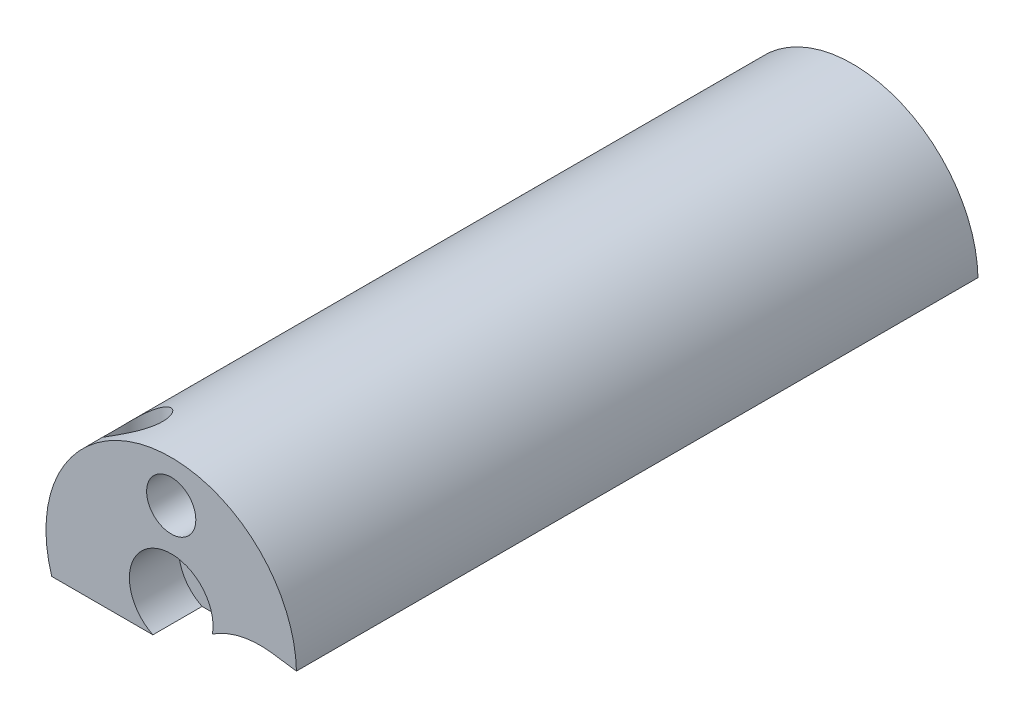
ISO-10303-21;
HEADER;
FILE_DESCRIPTION(('STEP AP214'),'2;1');
FILE_NAME('part.step','',(''),(''),'','','');
FILE_SCHEMA(('AUTOMOTIVE_DESIGN { 1 0 10303 214 1 1 1 1 }'));
ENDSEC;
DATA;
#1=APPLICATION_CONTEXT('core data for automotive mechanical design processes');
#2=APPLICATION_PROTOCOL_DEFINITION('international standard','automotive_design',2000,#1);
#3=PRODUCT_CONTEXT('',#1,'mechanical');
#4=PRODUCT('Part','Part','',(#3));
#5=PRODUCT_RELATED_PRODUCT_CATEGORY('part','',(#4));
#6=PRODUCT_DEFINITION_FORMATION('','',#4);
#7=PRODUCT_DEFINITION_CONTEXT('part definition',#1,'design');
#8=PRODUCT_DEFINITION('design','',#6,#7);
#9=PRODUCT_DEFINITION_SHAPE('','',#8);
#10=(LENGTH_UNIT() NAMED_UNIT(*) SI_UNIT(.MILLI.,.METRE.));
#11=(NAMED_UNIT(*) PLANE_ANGLE_UNIT() SI_UNIT($,.RADIAN.));
#12=(NAMED_UNIT(*) SI_UNIT($,.STERADIAN.) SOLID_ANGLE_UNIT());
#13=UNCERTAINTY_MEASURE_WITH_UNIT(LENGTH_MEASURE(1.E-05),#10,'distance_accuracy_value','');
#14=(GEOMETRIC_REPRESENTATION_CONTEXT(3) GLOBAL_UNCERTAINTY_ASSIGNED_CONTEXT((#13)) GLOBAL_UNIT_ASSIGNED_CONTEXT((#10,
#11,#12)) REPRESENTATION_CONTEXT('',''));
#15=CARTESIAN_POINT('',(0.,0.,0.));
#16=DIRECTION('',(0.,0.,1.));
#17=DIRECTION('',(1.,0.,0.));
#18=AXIS2_PLACEMENT_3D('',#15,#16,#17);
#19=CARTESIAN_POINT('',(-4.8888,-3.819375,0.));
#20=DIRECTION('',(0.,0.,1.));
#21=DIRECTION('',(1.,0.,0.));
#22=AXIS2_PLACEMENT_3D('',#19,#20,#21);
#23=PLANE('',#22);
#24=CARTESIAN_POINT('',(-4.8888,-0.423124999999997,0.));
#25=DIRECTION('',(0.,0.,1.));
#26=DIRECTION('',(1.,0.,0.));
#27=AXIS2_PLACEMENT_3D('',#24,#25,#26);
#28=CIRCLE('',#27,1.);
#29=CARTESIAN_POINT('',(-3.8888,-0.423124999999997,0.));
#30=VERTEX_POINT('',#29);
#31=EDGE_CURVE('E215',#30,#30,#28,.T.);
#32=ORIENTED_EDGE('',*,*,#31,.F.);
#33=EDGE_LOOP('',(#32));
#34=FACE_BOUND('',#33,.T.);
#35=CARTESIAN_POINT('',(-4.88880000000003,-3.819375,0.));
#36=DIRECTION('',(0.,0.,1.));
#37=DIRECTION('',(1.,0.,0.));
#38=AXIS2_PLACEMENT_3D('',#35,#36,#37);
#39=CIRCLE('',#38,1.7);
#40=CARTESIAN_POINT('',(-3.21332852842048,-4.10711680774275,0.));
#41=VERTEX_POINT('',#40);
#42=CARTESIAN_POINT('',(-5.63444062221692,-5.347125,0.));
#43=VERTEX_POINT('',#42);
#44=EDGE_CURVE('E101',#41,#43,#39,.T.);
#45=ORIENTED_EDGE('',*,*,#44,.F.);
#46=CARTESIAN_POINT('',(-1.27480840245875,-7.09870205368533,0.));
#47=DIRECTION('',(0.,0.,-1.));
#48=DIRECTION('',(1.,0.,0.));
#49=AXIS2_PLACEMENT_3D('',#46,#47,#48);
#50=CIRCLE('',#49,3.56475);
#51=CARTESIAN_POINT('',(-0.778691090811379,-3.56864395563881,0.));
#52=VERTEX_POINT('',#51);
#53=EDGE_CURVE('E142',#41,#52,#50,.T.);
#54=ORIENTED_EDGE('',*,*,#53,.T.);
#55=DIRECTION('',(0.990268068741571,-0.139173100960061,0.));
#56=VECTOR('',#55,1.);
#57=CARTESIAN_POINT('',(-0.778691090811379,-3.56864395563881,0.));
#58=LINE('',#57,#56);
#59=CARTESIAN_POINT('',(0.202449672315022,-3.70653429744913,0.));
#60=VERTEX_POINT('',#59);
#61=EDGE_CURVE('E144',#52,#60,#58,.T.);
#62=ORIENTED_EDGE('',*,*,#61,.T.);
#63=CARTESIAN_POINT('',(-4.8888,-3.819375,0.));
#64=DIRECTION('',(0.,0.,1.));
#65=DIRECTION('',(1.,0.,0.));
#66=AXIS2_PLACEMENT_3D('',#63,#64,#65);
#67=CIRCLE('',#66,5.0925);
#68=CARTESIAN_POINT('',(-9.7467353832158,-5.347125,0.));
#69=VERTEX_POINT('',#68);
#70=EDGE_CURVE('E132',#60,#69,#67,.T.);
#71=ORIENTED_EDGE('',*,*,#70,.T.);
#72=DIRECTION('',(1.,0.,0.));
#73=VECTOR('',#72,1.);
#74=CARTESIAN_POINT('',(-9.7467353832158,-5.347125,0.));
#75=LINE('',#74,#73);
#76=EDGE_CURVE('E140',#69,#43,#75,.T.);
#77=ORIENTED_EDGE('',*,*,#76,.T.);
#78=EDGE_LOOP('',(#45,#54,#62,#71,#77));
#79=FACE_BOUND('',#78,.T.);
#80=ADVANCED_FACE('F29',(#34,#79),#23,.T.);
#81=CARTESIAN_POINT('',(-4.9262264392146,-4.328625,-27.70925));
#82=DIRECTION('',(0.,0.,1.));
#83=DIRECTION('',(1.,0.,0.));
#84=AXIS2_PLACEMENT_3D('',#81,#82,#83);
#85=PLANE('',#84);
#86=CARTESIAN_POINT('',(-4.8888,-0.423124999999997,-27.70925));
#87=DIRECTION('',(0.,0.,1.));
#88=DIRECTION('',(1.,0.,0.));
#89=AXIS2_PLACEMENT_3D('',#86,#87,#88);
#90=CIRCLE('',#89,1.);
#91=CARTESIAN_POINT('',(-3.8888,-0.423124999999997,-27.70925));
#92=VERTEX_POINT('',#91);
#93=EDGE_CURVE('E234',#92,#92,#90,.T.);
#94=ORIENTED_EDGE('',*,*,#93,.T.);
#95=EDGE_LOOP('',(#94));
#96=FACE_BOUND('',#95,.T.);
#97=CARTESIAN_POINT('',(-4.8888,-3.819375,-27.70925));
#98=DIRECTION('',(0.,0.,1.));
#99=DIRECTION('',(1.,0.,0.));
#100=AXIS2_PLACEMENT_3D('',#97,#98,#99);
#101=CIRCLE('',#100,5.0925);
#102=CARTESIAN_POINT('',(-9.7467353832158,-5.347125,-27.70925));
#103=VERTEX_POINT('',#102);
#104=CARTESIAN_POINT('',(0.202449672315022,-3.70653429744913,-27.70925));
#105=VERTEX_POINT('',#104);
#106=EDGE_CURVE('E59',#103,#105,#101,.F.);
#107=ORIENTED_EDGE('',*,*,#106,.T.);
#108=DIRECTION('',(-0.990268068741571,0.139173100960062,0.));
#109=VECTOR('',#108,1.);
#110=CARTESIAN_POINT('',(-0.778691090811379,-3.56864395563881,-27.70925));
#111=LINE('',#110,#109);
#112=CARTESIAN_POINT('',(-0.778691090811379,-3.56864395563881,-27.70925));
#113=VERTEX_POINT('',#112);
#114=EDGE_CURVE('E57',#105,#113,#111,.T.);
#115=ORIENTED_EDGE('',*,*,#114,.T.);
#116=CARTESIAN_POINT('',(-1.27480840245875,-7.09870205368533,-27.70925));
#117=DIRECTION('',(0.,0.,1.));
#118=DIRECTION('',(1.,0.,0.));
#119=AXIS2_PLACEMENT_3D('',#116,#117,#118);
#120=CIRCLE('',#119,3.56475);
#121=CARTESIAN_POINT('',(-4.11480020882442,-4.94419767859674,-27.70925));
#122=VERTEX_POINT('',#121);
#123=EDGE_CURVE('E134',#113,#122,#120,.T.);
#124=ORIENTED_EDGE('',*,*,#123,.T.);
#125=CARTESIAN_POINT('',(-4.9262264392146,-4.328625,-27.70925));
#126=DIRECTION('',(0.,0.,1.));
#127=DIRECTION('',(1.,0.,0.));
#128=AXIS2_PLACEMENT_3D('',#125,#126,#127);
#129=CIRCLE('',#128,1.0185);
#130=CARTESIAN_POINT('',(-4.9262264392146,-5.347125,-27.70925));
#131=VERTEX_POINT('',#130);
#132=EDGE_CURVE('E62',#122,#131,#129,.F.);
#133=ORIENTED_EDGE('',*,*,#132,.T.);
#134=DIRECTION('',(-1.,0.,0.));
#135=VECTOR('',#134,1.);
#136=CARTESIAN_POINT('',(-9.7467353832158,-5.347125,-27.70925));
#137=LINE('',#136,#135);
#138=EDGE_CURVE('E47',#131,#103,#137,.T.);
#139=ORIENTED_EDGE('',*,*,#138,.T.);
#140=EDGE_LOOP('',(#107,#115,#124,#133,#139));
#141=FACE_BOUND('',#140,.T.);
#142=CARTESIAN_POINT('',(-4.88880000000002,-3.819375,-27.70925));
#143=DIRECTION('',(0.,0.,1.));
#144=DIRECTION('',(-0.960603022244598,0.277924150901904,0.));
#145=AXIS2_PLACEMENT_3D('',#142,#143,#144);
#146=CIRCLE('',#145,0.75);
#147=CARTESIAN_POINT('',(-5.60925226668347,-3.61093188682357,-27.70925));
#148=VERTEX_POINT('',#147);
#149=EDGE_CURVE('E119',#148,#148,#146,.T.);
#150=ORIENTED_EDGE('',*,*,#149,.T.);
#151=EDGE_LOOP('',(#150));
#152=FACE_BOUND('',#151,.T.);
#153=ADVANCED_FACE('F168',(#96,#141,#152),#85,.F.);
#154=CARTESIAN_POINT('',(-4.8888,-3.819375,-39.8557090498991));
#155=DIRECTION('',(0.,0.,1.));
#156=DIRECTION('',(1.,0.,0.));
#157=AXIS2_PLACEMENT_3D('',#154,#155,#156);
#158=CYLINDRICAL_SURFACE('',#157,5.0925);
#159=CARTESIAN_POINT('',(-7.63875,0.466804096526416,-0.399999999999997));
#160=CARTESIAN_POINT('',(-7.58045521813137,0.504201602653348,-0.400002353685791));
#161=CARTESIAN_POINT('',(-7.52131379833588,0.540454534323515,-0.405105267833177));
#162=CARTESIAN_POINT('',(-7.40296564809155,0.609761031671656,-0.426333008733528));
#163=CARTESIAN_POINT('',(-7.34375900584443,0.642808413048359,-0.442478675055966));
#164=CARTESIAN_POINT('',(-7.22713374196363,0.705018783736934,-0.486503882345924));
#165=CARTESIAN_POINT('',(-7.16972770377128,0.734157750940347,-0.514451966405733));
#166=CARTESIAN_POINT('',(-7.0598016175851,0.787580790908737,-0.582093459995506));
#167=CARTESIAN_POINT('',(-7.00727570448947,0.81187073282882,-0.621772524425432));
#168=CARTESIAN_POINT('',(-6.91594668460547,0.852501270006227,-0.706494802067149));
#169=CARTESIAN_POINT('',(-6.87625071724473,0.869451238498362,-0.750284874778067));
#170=CARTESIAN_POINT('',(-6.80470885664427,0.89913680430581,-0.84511615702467));
#171=CARTESIAN_POINT('',(-6.77285901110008,0.911874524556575,-0.89615369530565));
#172=CARTESIAN_POINT('',(-6.72111817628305,0.932137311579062,-0.998817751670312));
#173=CARTESIAN_POINT('',(-6.70039288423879,0.940035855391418,-1.04995206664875));
#174=CARTESIAN_POINT('',(-6.66758109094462,0.952396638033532,-1.1553123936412));
#175=CARTESIAN_POINT('',(-6.65549208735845,0.956859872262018,-1.20953750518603));
#176=CARTESIAN_POINT('',(-6.64075584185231,0.962284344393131,-1.31725049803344));
#177=CARTESIAN_POINT('',(-6.63775753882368,0.963375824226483,-1.37068415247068));
#178=CARTESIAN_POINT('',(-6.64031854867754,0.962438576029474,-1.47731603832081));
#179=CARTESIAN_POINT('',(-6.64587702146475,0.960410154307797,-1.53051429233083));
#180=CARTESIAN_POINT('',(-6.66524133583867,0.953246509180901,-1.63464796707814));
#181=CARTESIAN_POINT('',(-6.67896930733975,0.948140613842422,-1.68559993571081));
#182=CARTESIAN_POINT('',(-6.71407853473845,0.934808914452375,-1.78435533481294));
#183=CARTESIAN_POINT('',(-6.73545966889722,0.926583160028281,-1.83215881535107));
#184=CARTESIAN_POINT('',(-6.7853173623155,0.906881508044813,-1.92383527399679));
#185=CARTESIAN_POINT('',(-6.81386513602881,0.895372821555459,-1.96766240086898));
#186=CARTESIAN_POINT('',(-6.8768530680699,0.86916016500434,-2.04976255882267));
#187=CARTESIAN_POINT('',(-6.91129377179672,0.85445589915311,-2.08803507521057));
#188=CARTESIAN_POINT('',(-6.98616072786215,0.821353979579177,-2.15954146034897));
#189=CARTESIAN_POINT('',(-7.02675917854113,0.802841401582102,-2.19254130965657));
#190=CARTESIAN_POINT('',(-7.111497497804,0.762695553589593,-2.25127274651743));
#191=CARTESIAN_POINT('',(-7.15563826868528,0.741061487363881,-2.27700247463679));
#192=CARTESIAN_POINT('',(-7.24954343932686,0.693210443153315,-2.32274073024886));
#193=CARTESIAN_POINT('',(-7.2994796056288,0.666769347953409,-2.3421600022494));
#194=CARTESIAN_POINT('',(-7.40033431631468,0.611096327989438,-2.37259293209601));
#195=CARTESIAN_POINT('',(-7.45125332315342,0.581863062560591,-2.38360252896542));
#196=CARTESIAN_POINT('',(-7.55910521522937,0.517379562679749,-2.39848613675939));
#197=CARTESIAN_POINT('',(-7.61600412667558,0.481832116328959,-2.40131089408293));
#198=CARTESIAN_POINT('',(-7.72811000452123,0.408670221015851,-2.39757943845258));
#199=CARTESIAN_POINT('',(-7.78331641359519,0.371055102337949,-2.39102016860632));
#200=CARTESIAN_POINT('',(-7.89908949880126,0.288844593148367,-2.36758099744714));
#201=CARTESIAN_POINT('',(-7.95922990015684,0.244043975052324,-2.34930945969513));
#202=CARTESIAN_POINT('',(-8.074928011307,0.153978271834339,-2.30203297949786));
#203=CARTESIAN_POINT('',(-8.13047676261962,0.108712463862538,-2.27300763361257));
#204=CARTESIAN_POINT('',(-8.24129351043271,0.0147016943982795,-2.20109397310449));
#205=CARTESIAN_POINT('',(-8.29594431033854,-0.0339219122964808,-2.15708640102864));
#206=CARTESIAN_POINT('',(-8.39649049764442,-0.126908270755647,-2.05640557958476));
#207=CARTESIAN_POINT('',(-8.44241159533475,-0.171283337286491,-1.99977062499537));
#208=CARTESIAN_POINT('',(-8.50551822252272,-0.234130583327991,-1.90054297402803));
#209=CARTESIAN_POINT('',(-8.52659798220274,-0.255568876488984,-1.8622906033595));
#210=CARTESIAN_POINT('',(-8.56412878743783,-0.294288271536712,-1.78163398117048));
#211=CARTESIAN_POINT('',(-8.58058792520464,-0.311576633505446,-1.73923716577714));
#212=CARTESIAN_POINT('',(-8.60565954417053,-0.338169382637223,-1.65804009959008));
#213=CARTESIAN_POINT('',(-8.61511371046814,-0.34831580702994,-1.6197799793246));
#214=CARTESIAN_POINT('',(-8.62949052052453,-0.363813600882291,-1.54146917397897));
#215=CARTESIAN_POINT('',(-8.63441662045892,-0.369168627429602,-1.50141987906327));
#216=CARTESIAN_POINT('',(-8.63936370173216,-0.374546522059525,-1.42050177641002));
#217=CARTESIAN_POINT('',(-8.63936641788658,-0.374549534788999,-1.37963047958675));
#218=CARTESIAN_POINT('',(-8.63442005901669,-0.369172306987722,-1.29854873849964));
#219=CARTESIAN_POINT('',(-8.62946951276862,-0.363790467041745,-1.25833849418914));
#220=CARTESIAN_POINT('',(-8.61539165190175,-0.348615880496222,-1.1818086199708));
#221=CARTESIAN_POINT('',(-8.60649636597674,-0.339068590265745,-1.14539550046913));
#222=CARTESIAN_POINT('',(-8.58512518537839,-0.316379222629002,-1.07482981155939));
#223=CARTESIAN_POINT('',(-8.57264757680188,-0.303235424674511,-1.04067833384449));
#224=CARTESIAN_POINT('',(-8.53731885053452,-0.26651658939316,-0.957814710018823));
#225=CARTESIAN_POINT('',(-8.51245027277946,-0.241074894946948,-0.910788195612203));
#226=CARTESIAN_POINT('',(-8.45711356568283,-0.185887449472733,-0.822947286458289));
#227=CARTESIAN_POINT('',(-8.42663122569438,-0.156130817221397,-0.782149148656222));
#228=CARTESIAN_POINT('',(-8.34982446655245,-0.083262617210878,-0.693679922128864));
#229=CARTESIAN_POINT('',(-8.30166078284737,-0.039082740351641,-0.648485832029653));
#230=CARTESIAN_POINT('',(-8.19875184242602,0.0513467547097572,-0.568957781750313));
#231=CARTESIAN_POINT('',(-8.14399842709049,0.0975988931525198,-0.53463747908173));
#232=CARTESIAN_POINT('',(-8.02819358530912,0.19103525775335,-0.476640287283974));
#233=CARTESIAN_POINT('',(-7.96705620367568,0.238222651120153,-0.453140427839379));
#234=CARTESIAN_POINT('',(-7.84056155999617,0.331139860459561,-0.418395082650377));
#235=CARTESIAN_POINT('',(-7.77521909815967,0.376874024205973,-0.407108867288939));
#236=CARTESIAN_POINT('',(-7.68545870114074,0.436566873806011,-0.400821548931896));
#237=CARTESIAN_POINT('',(-7.66217269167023,0.451777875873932,-0.399999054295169));
#238=CARTESIAN_POINT('',(-7.63875,0.466804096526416,-0.399999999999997));
#239=B_SPLINE_CURVE_WITH_KNOTS('',3,(#159,#160,#161,#162,#163,#164,#165,#166,#167,#168,#169,
#170,#171,#172,#173,#174,#175,#176,#177,#178,#179,#180,#181,#182,#183,#184,#185,#186,#187,#188,
#189,#190,#191,#192,#193,#194,#195,#196,#197,#198,#199,#200,#201,#202,#203,#204,#205,#206,#207,
#208,#209,#210,#211,#212,#213,#214,#215,#216,#217,#218,#219,#220,#221,#222,#223,#224,#225,#226,
#227,#228,#229,#230,#231,#232,#233,#234,#235,#236,#237,#238),.UNSPECIFIED.,.T.,.F.,(4,2,2,2,2,2,
2,2,2,2,2,2,2,2,2,2,2,2,2,2,2,2,2,2,2,2,2,2,2,2,2,2,2,2,2,2,2,2,2,4),(0.,0.20770364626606,
0.41580035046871,0.625122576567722,0.834189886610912,1.01763816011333,1.20099383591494,
1.36737024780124,1.53369843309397,1.69351594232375,1.85331776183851,2.01162024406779,
2.16992020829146,2.32986017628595,2.48981495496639,2.65559010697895,2.82140761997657,
2.99992745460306,3.17853344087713,3.37919885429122,3.5799296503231,3.81055697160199,
4.04162412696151,4.29647073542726,4.55055474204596,4.69606959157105,4.84132798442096,
4.96291025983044,5.08439965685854,5.20633976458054,5.32831610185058,5.44391197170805,
5.55956323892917,5.73547777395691,5.91184389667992,6.14899137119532,6.38643553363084,
6.62763730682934,6.8680322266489,6.95148701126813),.UNSPECIFIED.);
#240=CARTESIAN_POINT('',(-7.63875,0.466804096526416,-0.399999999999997));
#241=VERTEX_POINT('',#240);
#242=EDGE_CURVE('E212',#241,#241,#239,.T.);
#243=ORIENTED_EDGE('',*,*,#242,.F.);
#244=EDGE_LOOP('',(#243));
#245=FACE_BOUND('',#244,.T.);
#246=ORIENTED_EDGE('',*,*,#106,.F.);
#247=DIRECTION('',(0.,0.,1.));
#248=VECTOR('',#247,1.);
#249=CARTESIAN_POINT('',(-9.7467353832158,-5.347125,-39.8557090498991));
#250=LINE('',#249,#248);
#251=EDGE_CURVE('E147',#103,#69,#250,.T.);
#252=ORIENTED_EDGE('',*,*,#251,.T.);
#253=ORIENTED_EDGE('',*,*,#70,.F.);
#254=DIRECTION('',(0.,0.,1.));
#255=VECTOR('',#254,1.);
#256=CARTESIAN_POINT('',(0.202449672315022,-3.70653429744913,-39.8557090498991));
#257=LINE('',#256,#255);
#258=EDGE_CURVE('E69',#105,#60,#257,.T.);
#259=ORIENTED_EDGE('',*,*,#258,.F.);
#260=EDGE_LOOP('',(#246,#252,#253,#259));
#261=FACE_BOUND('',#260,.T.);
#262=ADVANCED_FACE('F31',(#245,#261),#158,.T.);
#263=CARTESIAN_POINT('',(-0.778691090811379,-3.56864395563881,-39.8557090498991));
#264=DIRECTION('',(-0.139173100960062,-0.990268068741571,0.));
#265=DIRECTION('',(0.990268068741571,-0.139173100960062,0.));
#266=AXIS2_PLACEMENT_3D('',#263,#264,#265);
#267=PLANE('',#266);
#268=ORIENTED_EDGE('',*,*,#114,.F.);
#269=ORIENTED_EDGE('',*,*,#258,.T.);
#270=ORIENTED_EDGE('',*,*,#61,.F.);
#271=DIRECTION('',(0.,0.,1.));
#272=VECTOR('',#271,1.);
#273=CARTESIAN_POINT('',(-0.778691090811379,-3.56864395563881,-39.8557090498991));
#274=LINE('',#273,#272);
#275=EDGE_CURVE('E149',#113,#52,#274,.T.);
#276=ORIENTED_EDGE('',*,*,#275,.F.);
#277=EDGE_LOOP('',(#268,#269,#270,#276));
#278=FACE_BOUND('',#277,.T.);
#279=ADVANCED_FACE('F167',(#278),#267,.T.);
#280=CARTESIAN_POINT('',(-1.27480840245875,-7.09870205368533,-39.8557090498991));
#281=DIRECTION('',(0.,0.,1.));
#282=DIRECTION('',(1.,0.,0.));
#283=AXIS2_PLACEMENT_3D('',#280,#281,#282);
#284=CYLINDRICAL_SURFACE('',#283,3.56475);
#285=DIRECTION('',(0.,0.,1.));
#286=VECTOR('',#285,1.);
#287=CARTESIAN_POINT('',(-3.21332852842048,-4.10711680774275,-1.));
#288=LINE('',#287,#286);
#289=CARTESIAN_POINT('',(-3.21332852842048,-4.10711680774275,-2.));
#290=VERTEX_POINT('',#289);
#291=EDGE_CURVE('E117',#290,#41,#288,.T.);
#292=ORIENTED_EDGE('',*,*,#291,.F.);
#293=CARTESIAN_POINT('',(-1.27480840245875,-7.09870205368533,-2.));
#294=DIRECTION('',(0.,0.,-1.));
#295=DIRECTION('',(-1.,0.,0.));
#296=AXIS2_PLACEMENT_3D('',#293,#294,#295);
#297=CIRCLE('',#296,3.56475);
#298=CARTESIAN_POINT('',(-4.11480020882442,-4.94419767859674,-2.));
#299=VERTEX_POINT('',#298);
#300=EDGE_CURVE('E113',#299,#290,#297,.T.);
#301=ORIENTED_EDGE('',*,*,#300,.F.);
#302=DIRECTION('',(0.,0.,1.));
#303=VECTOR('',#302,1.);
#304=CARTESIAN_POINT('',(-4.11480020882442,-4.94419767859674,-39.8557090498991));
#305=LINE('',#304,#303);
#306=EDGE_CURVE('E152',#122,#299,#305,.T.);
#307=ORIENTED_EDGE('',*,*,#306,.F.);
#308=ORIENTED_EDGE('',*,*,#123,.F.);
#309=ORIENTED_EDGE('',*,*,#275,.T.);
#310=ORIENTED_EDGE('',*,*,#53,.F.);
#311=EDGE_LOOP('',(#292,#301,#307,#308,#309,#310));
#312=FACE_BOUND('',#311,.T.);
#313=ADVANCED_FACE('F160',(#312),#284,.F.);
#314=CARTESIAN_POINT('',(-4.9262264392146,-4.328625,-39.8557090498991));
#315=DIRECTION('',(0.,0.,1.));
#316=DIRECTION('',(1.,0.,0.));
#317=AXIS2_PLACEMENT_3D('',#314,#315,#316);
#318=CYLINDRICAL_SURFACE('',#317,1.0185);
#319=CARTESIAN_POINT('',(-4.9262264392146,-4.328625,-2.));
#320=DIRECTION('',(0.,0.,-1.));
#321=DIRECTION('',(-1.,0.,0.));
#322=AXIS2_PLACEMENT_3D('',#319,#320,#321);
#323=CIRCLE('',#322,1.0185);
#324=CARTESIAN_POINT('',(-4.9262264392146,-5.347125,-2.));
#325=VERTEX_POINT('',#324);
#326=EDGE_CURVE('E39',#325,#299,#323,.F.);
#327=ORIENTED_EDGE('',*,*,#326,.F.);
#328=DIRECTION('',(0.,0.,1.));
#329=VECTOR('',#328,1.);
#330=CARTESIAN_POINT('',(-4.9262264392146,-5.347125,-39.8557090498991));
#331=LINE('',#330,#329);
#332=EDGE_CURVE('E116',#131,#325,#331,.T.);
#333=ORIENTED_EDGE('',*,*,#332,.F.);
#334=ORIENTED_EDGE('',*,*,#132,.F.);
#335=ORIENTED_EDGE('',*,*,#306,.T.);
#336=EDGE_LOOP('',(#327,#333,#334,#335));
#337=FACE_BOUND('',#336,.T.);
#338=ADVANCED_FACE('F162',(#337),#318,.T.);
#339=CARTESIAN_POINT('',(-9.7467353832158,-5.347125,-39.8557090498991));
#340=DIRECTION('',(0.,-1.,0.));
#341=DIRECTION('',(1.,0.,0.));
#342=AXIS2_PLACEMENT_3D('',#339,#340,#341);
#343=PLANE('',#342);
#344=CARTESIAN_POINT('',(-7.63875,-5.347125,-1.4));
#345=DIRECTION('',(0.,1.,0.));
#346=DIRECTION('',(0.,0.,1.));
#347=AXIS2_PLACEMENT_3D('',#344,#345,#346);
#348=CIRCLE('',#347,1.);
#349=CARTESIAN_POINT('',(-7.63875,-5.347125,-0.399999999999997));
#350=VERTEX_POINT('',#349);
#351=EDGE_CURVE('E210',#350,#350,#348,.T.);
#352=ORIENTED_EDGE('',*,*,#351,.T.);
#353=EDGE_LOOP('',(#352));
#354=FACE_BOUND('',#353,.T.);
#355=DIRECTION('',(1.,0.,0.));
#356=VECTOR('',#355,1.);
#357=CARTESIAN_POINT('',(-9.7467353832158,-5.347125,-2.));
#358=LINE('',#357,#356);
#359=CARTESIAN_POINT('',(-5.63444062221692,-5.347125,-2.));
#360=VERTEX_POINT('',#359);
#361=EDGE_CURVE('E110',#360,#325,#358,.T.);
#362=ORIENTED_EDGE('',*,*,#361,.F.);
#363=DIRECTION('',(0.,0.,1.));
#364=VECTOR('',#363,1.);
#365=CARTESIAN_POINT('',(-5.63444062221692,-5.347125,-6.80832611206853));
#366=LINE('',#365,#364);
#367=EDGE_CURVE('E11',#43,#360,#366,.F.);
#368=ORIENTED_EDGE('',*,*,#367,.F.);
#369=ORIENTED_EDGE('',*,*,#76,.F.);
#370=ORIENTED_EDGE('',*,*,#251,.F.);
#371=ORIENTED_EDGE('',*,*,#138,.F.);
#372=ORIENTED_EDGE('',*,*,#332,.T.);
#373=EDGE_LOOP('',(#362,#368,#369,#370,#371,#372));
#374=FACE_BOUND('',#373,.T.);
#375=ADVANCED_FACE('F115',(#354,#374),#343,.T.);
#376=CARTESIAN_POINT('',(-4.88880000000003,-3.819375,-2.));
#377=DIRECTION('',(0.,0.,-1.));
#378=DIRECTION('',(0.960603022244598,-0.277924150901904,0.));
#379=AXIS2_PLACEMENT_3D('',#376,#377,#378);
#380=PLANE('',#379);
#381=ORIENTED_EDGE('',*,*,#300,.T.);
#382=CARTESIAN_POINT('',(-4.88880000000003,-3.819375,-2.));
#383=DIRECTION('',(0.,0.,-1.));
#384=DIRECTION('',(-1.,0.,0.));
#385=AXIS2_PLACEMENT_3D('',#382,#383,#384);
#386=CIRCLE('',#385,1.7);
#387=EDGE_CURVE('E98',#290,#360,#386,.F.);
#388=ORIENTED_EDGE('',*,*,#387,.T.);
#389=ORIENTED_EDGE('',*,*,#361,.T.);
#390=ORIENTED_EDGE('',*,*,#326,.T.);
#391=EDGE_LOOP('',(#381,#388,#389,#390));
#392=FACE_BOUND('',#391,.T.);
#393=CARTESIAN_POINT('',(-4.88880000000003,-3.819375,-2.));
#394=DIRECTION('',(0.,0.,-1.));
#395=DIRECTION('',(0.960603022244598,-0.277924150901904,0.));
#396=AXIS2_PLACEMENT_3D('',#393,#394,#395);
#397=CIRCLE('',#396,0.95);
#398=CARTESIAN_POINT('',(-3.97622712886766,-4.0834029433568,-2.));
#399=VERTEX_POINT('',#398);
#400=EDGE_CURVE('E126',#399,#399,#397,.F.);
#401=ORIENTED_EDGE('',*,*,#400,.F.);
#402=EDGE_LOOP('',(#401));
#403=FACE_BOUND('',#402,.T.);
#404=ADVANCED_FACE('F108',(#392,#403),#380,.F.);
#405=CARTESIAN_POINT('',(-4.8888,-3.819375,-202.12132034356));
#406=DIRECTION('',(0.,0.,1.));
#407=DIRECTION('',(-0.960603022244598,0.277924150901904,0.));
#408=AXIS2_PLACEMENT_3D('',#405,#406,#407);
#409=CYLINDRICAL_SURFACE('',#408,0.75);
#410=ORIENTED_EDGE('',*,*,#149,.F.);
#411=EDGE_LOOP('',(#410));
#412=FACE_BOUND('',#411,.T.);
#413=CARTESIAN_POINT('',(-4.88880000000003,-3.819375,-2.20000000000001));
#414=DIRECTION('',(0.,0.,-1.));
#415=DIRECTION('',(0.960603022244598,-0.277924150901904,0.));
#416=AXIS2_PLACEMENT_3D('',#413,#414,#415);
#417=CIRCLE('',#416,0.75);
#418=CARTESIAN_POINT('',(-4.16834773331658,-4.02781811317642,-2.20000000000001));
#419=VERTEX_POINT('',#418);
#420=EDGE_CURVE('E123',#419,#419,#417,.T.);
#421=ORIENTED_EDGE('',*,*,#420,.F.);
#422=EDGE_LOOP('',(#421));
#423=FACE_BOUND('',#422,.T.);
#424=ADVANCED_FACE('F175',(#412,#423),#409,.F.);
#425=CARTESIAN_POINT('',(-4.88880000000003,-3.819375,-2.20000000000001));
#426=DIRECTION('',(0.,0.,-1.));
#427=DIRECTION('',(0.960603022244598,-0.277924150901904,0.));
#428=AXIS2_PLACEMENT_3D('',#425,#426,#427);
#429=TOROIDAL_SURFACE('',#428,0.95,0.2);
#430=ORIENTED_EDGE('',*,*,#400,.T.);
#431=EDGE_LOOP('',(#430));
#432=FACE_BOUND('',#431,.T.);
#433=ORIENTED_EDGE('',*,*,#420,.T.);
#434=EDGE_LOOP('',(#433));
#435=FACE_BOUND('',#434,.T.);
#436=ADVANCED_FACE('F178',(#432,#435),#429,.T.);
#437=CARTESIAN_POINT('',(-4.88880000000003,-3.819375,-6.80832611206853));
#438=DIRECTION('',(0.,0.,1.));
#439=DIRECTION('',(1.,0.,0.));
#440=AXIS2_PLACEMENT_3D('',#437,#438,#439);
#441=CYLINDRICAL_SURFACE('',#440,1.7);
#442=ORIENTED_EDGE('',*,*,#291,.T.);
#443=ORIENTED_EDGE('',*,*,#44,.T.);
#444=ORIENTED_EDGE('',*,*,#367,.T.);
#445=ORIENTED_EDGE('',*,*,#387,.F.);
#446=EDGE_LOOP('',(#442,#443,#444,#445));
#447=FACE_BOUND('',#446,.T.);
#448=ADVANCED_FACE('F97',(#447),#441,.F.);
#449=CARTESIAN_POINT('',(-4.8888,-0.423124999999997,-27.70925));
#450=DIRECTION('',(0.,0.,1.));
#451=DIRECTION('',(1.,0.,0.));
#452=AXIS2_PLACEMENT_3D('',#449,#450,#451);
#453=CYLINDRICAL_SURFACE('',#452,1.);
#454=CARTESIAN_POINT('',(-3.8888,-0.423124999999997,-27.70925));
#455=CARTESIAN_POINT('',(-3.8888,-0.423124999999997,-27.4206119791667));
#456=CARTESIAN_POINT('',(-3.8888,-0.423124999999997,-27.1319739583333));
#457=CARTESIAN_POINT('',(-3.8888,-0.423124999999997,-26.5546979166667));
#458=CARTESIAN_POINT('',(-3.8888,-0.423124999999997,-26.2660598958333));
#459=CARTESIAN_POINT('',(-3.8888,-0.423124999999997,-25.6887838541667));
#460=CARTESIAN_POINT('',(-3.8888,-0.423124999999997,-25.4001458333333));
#461=CARTESIAN_POINT('',(-3.8888,-0.423124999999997,-24.8228697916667));
#462=CARTESIAN_POINT('',(-3.8888,-0.423124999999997,-24.5342317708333));
#463=CARTESIAN_POINT('',(-3.8888,-0.423124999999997,-23.9569557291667));
#464=CARTESIAN_POINT('',(-3.8888,-0.423124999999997,-23.6683177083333));
#465=CARTESIAN_POINT('',(-3.8888,-0.423124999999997,-23.0910416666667));
#466=CARTESIAN_POINT('',(-3.8888,-0.423124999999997,-22.8024036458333));
#467=CARTESIAN_POINT('',(-3.8888,-0.423124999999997,-22.2251276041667));
#468=CARTESIAN_POINT('',(-3.8888,-0.423124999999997,-21.9364895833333));
#469=CARTESIAN_POINT('',(-3.8888,-0.423124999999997,-21.3592135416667));
#470=CARTESIAN_POINT('',(-3.8888,-0.423124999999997,-21.0705755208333));
#471=CARTESIAN_POINT('',(-3.8888,-0.423124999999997,-20.4932994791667));
#472=CARTESIAN_POINT('',(-3.8888,-0.423124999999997,-20.2046614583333));
#473=CARTESIAN_POINT('',(-3.8888,-0.423124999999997,-19.6273854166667));
#474=CARTESIAN_POINT('',(-3.8888,-0.423124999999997,-19.3387473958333));
#475=CARTESIAN_POINT('',(-3.8888,-0.423124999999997,-18.7614713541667));
#476=CARTESIAN_POINT('',(-3.8888,-0.423124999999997,-18.4728333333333));
#477=CARTESIAN_POINT('',(-3.8888,-0.423124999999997,-17.8955572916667));
#478=CARTESIAN_POINT('',(-3.8888,-0.423124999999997,-17.6069192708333));
#479=CARTESIAN_POINT('',(-3.8888,-0.423124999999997,-17.0296432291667));
#480=CARTESIAN_POINT('',(-3.8888,-0.423124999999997,-16.7410052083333));
#481=CARTESIAN_POINT('',(-3.8888,-0.423124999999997,-16.1637291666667));
#482=CARTESIAN_POINT('',(-3.8888,-0.423124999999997,-15.8750911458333));
#483=CARTESIAN_POINT('',(-3.8888,-0.423124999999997,-15.2978151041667));
#484=CARTESIAN_POINT('',(-3.8888,-0.423124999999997,-15.0091770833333));
#485=CARTESIAN_POINT('',(-3.8888,-0.423124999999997,-14.4319010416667));
#486=CARTESIAN_POINT('',(-3.8888,-0.423124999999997,-14.1432630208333));
#487=CARTESIAN_POINT('',(-3.8888,-0.423124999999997,-13.5659869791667));
#488=CARTESIAN_POINT('',(-3.8888,-0.423124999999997,-13.2773489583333));
#489=CARTESIAN_POINT('',(-3.8888,-0.423124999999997,-12.7000729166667));
#490=CARTESIAN_POINT('',(-3.8888,-0.423124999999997,-12.4114348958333));
#491=CARTESIAN_POINT('',(-3.8888,-0.423124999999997,-11.8341588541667));
#492=CARTESIAN_POINT('',(-3.8888,-0.423124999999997,-11.5455208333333));
#493=CARTESIAN_POINT('',(-3.8888,-0.423124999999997,-10.9682447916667));
#494=CARTESIAN_POINT('',(-3.8888,-0.423124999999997,-10.6796067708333));
#495=CARTESIAN_POINT('',(-3.8888,-0.423124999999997,-10.1023307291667));
#496=CARTESIAN_POINT('',(-3.8888,-0.423124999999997,-9.81369270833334));
#497=CARTESIAN_POINT('',(-3.8888,-0.423124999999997,-9.23641666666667));
#498=CARTESIAN_POINT('',(-3.8888,-0.423124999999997,-8.94777864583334));
#499=CARTESIAN_POINT('',(-3.8888,-0.423124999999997,-8.37050260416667));
#500=CARTESIAN_POINT('',(-3.8888,-0.423124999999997,-8.08186458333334));
#501=CARTESIAN_POINT('',(-3.8888,-0.423124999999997,-7.50458854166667));
#502=CARTESIAN_POINT('',(-3.8888,-0.423124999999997,-7.21595052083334));
#503=CARTESIAN_POINT('',(-3.8888,-0.423124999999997,-6.63867447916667));
#504=CARTESIAN_POINT('',(-3.8888,-0.423124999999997,-6.35003645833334));
#505=CARTESIAN_POINT('',(-3.8888,-0.423124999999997,-5.77276041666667));
#506=CARTESIAN_POINT('',(-3.8888,-0.423124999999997,-5.48412239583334));
#507=CARTESIAN_POINT('',(-3.8888,-0.423124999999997,-4.90684635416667));
#508=CARTESIAN_POINT('',(-3.8888,-0.423124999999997,-4.61820833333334));
#509=CARTESIAN_POINT('',(-3.8888,-0.423124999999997,-4.04093229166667));
#510=CARTESIAN_POINT('',(-3.8888,-0.423124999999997,-3.75229427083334));
#511=CARTESIAN_POINT('',(-3.8888,-0.423124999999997,-3.17501822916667));
#512=CARTESIAN_POINT('',(-3.8888,-0.423124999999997,-2.88638020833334));
#513=CARTESIAN_POINT('',(-3.8888,-0.423124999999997,-2.30910416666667));
#514=CARTESIAN_POINT('',(-3.8888,-0.423124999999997,-2.02046614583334));
#515=CARTESIAN_POINT('',(-3.8888,-0.423124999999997,-1.44319010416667));
#516=CARTESIAN_POINT('',(-3.8888,-0.423124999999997,-1.15455208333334));
#517=CARTESIAN_POINT('',(-3.8888,-0.423124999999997,-0.577276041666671));
#518=CARTESIAN_POINT('',(-3.8888,-0.423124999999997,-0.288638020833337));
#519=CARTESIAN_POINT('',(-3.8888,-0.423124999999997,0.));
#520=B_SPLINE_CURVE_WITH_KNOTS('',3,(#454,#455,#456,#457,#458,#459,#460,#461,#462,#463,#464,
#465,#466,#467,#468,#469,#470,#471,#472,#473,#474,#475,#476,#477,#478,#479,#480,#481,#482,#483,
#484,#485,#486,#487,#488,#489,#490,#491,#492,#493,#494,#495,#496,#497,#498,#499,#500,#501,#502,
#503,#504,#505,#506,#507,#508,#509,#510,#511,#512,#513,#514,#515,#516,#517,#518,#519),
.UNSPECIFIED.,.F.,.F.,(4,2,2,2,2,2,2,2,2,2,2,2,2,2,2,2,2,2,2,2,2,2,2,2,2,2,2,2,2,2,2,2,4),(0.,
0.865914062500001,1.731828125,2.5977421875,3.46365625,4.3295703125,5.195484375,6.0613984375,
6.9273125,7.7932265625,8.659140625,9.5250546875,10.39096875,11.2568828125,12.122796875,
12.9887109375,13.854625,14.7205390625,15.586453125,16.4523671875,17.31828125,18.1841953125,
19.050109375,19.9160234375,20.7819375,21.6478515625,22.513765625,23.3796796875,24.24559375,
25.1115078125,25.977421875,26.8433359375,27.70925),.UNSPECIFIED.);
#521=EDGE_CURVE('BSEAM188',#92,#30,#520,.T.);
#522=ORIENTED_EDGE('',*,*,#93,.F.);
#523=ORIENTED_EDGE('',*,*,#31,.T.);
#524=ORIENTED_EDGE('',*,*,#521,.T.);
#525=ORIENTED_EDGE('',*,*,#521,.F.);
#526=EDGE_LOOP('',(#522,#524,#523,#525));
#527=FACE_BOUND('',#526,.T.);
#528=ADVANCED_FACE('F188',(#527),#453,.F.);
#529=CARTESIAN_POINT('',(-7.63875,-5.347125,-1.4));
#530=DIRECTION('',(0.,1.,0.));
#531=DIRECTION('',(0.,0.,1.));
#532=AXIS2_PLACEMENT_3D('',#529,#530,#531);
#533=CYLINDRICAL_SURFACE('',#532,1.);
#534=ORIENTED_EDGE('',*,*,#242,.T.);
#535=EDGE_LOOP('',(#534));
#536=FACE_BOUND('',#535,.T.);
#537=ORIENTED_EDGE('',*,*,#351,.F.);
#538=EDGE_LOOP('',(#537));
#539=FACE_BOUND('',#538,.T.);
#540=ADVANCED_FACE('F222',(#536,#539),#533,.F.);
#541=CLOSED_SHELL('',(#80,#153,#262,#279,#313,#338,#375,#404,#424,#436,#448,#528,#540));
#542=MANIFOLD_SOLID_BREP('B2',#541);
#543=ADVANCED_BREP_SHAPE_REPRESENTATION('',(#18,#542),#14);
#544=SHAPE_DEFINITION_REPRESENTATION(#9,#543);
ENDSEC;
END-ISO-10303-21;
